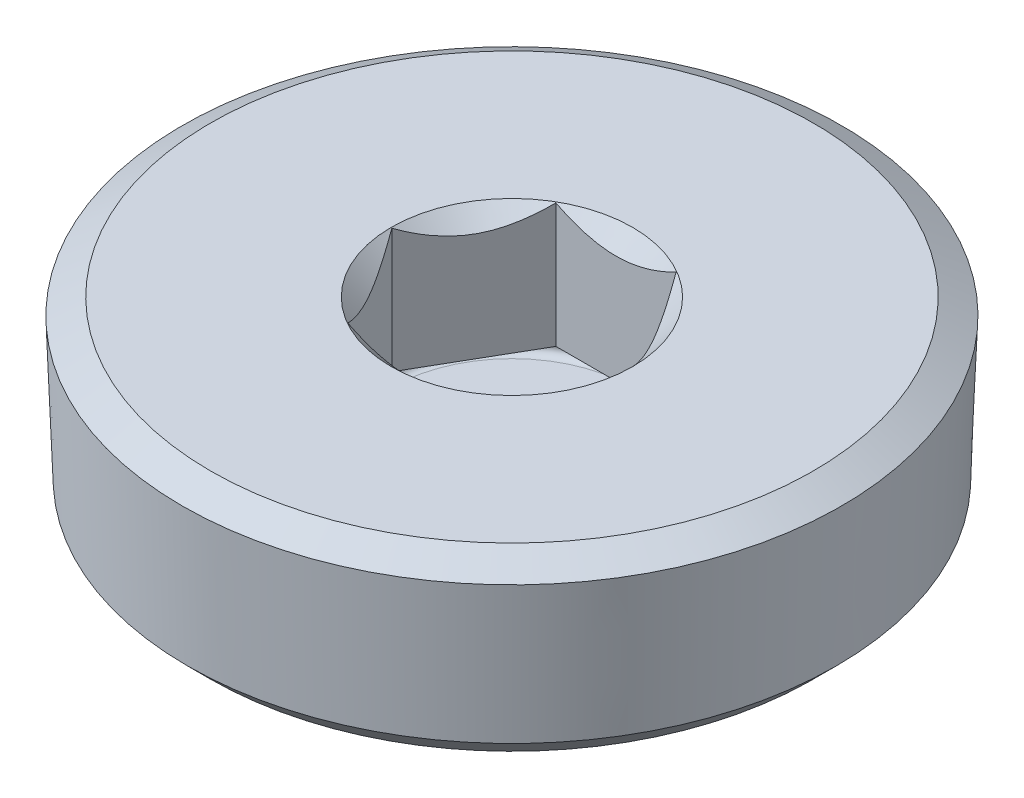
ISO-10303-21;
HEADER;
FILE_DESCRIPTION(('STEP AP214'),'2;1');
FILE_NAME('part.step','',(''),(''),'','','');
FILE_SCHEMA(('AUTOMOTIVE_DESIGN { 1 0 10303 214 1 1 1 1 }'));
ENDSEC;
DATA;
#1=APPLICATION_CONTEXT('core data for automotive mechanical design processes');
#2=APPLICATION_PROTOCOL_DEFINITION('international standard','automotive_design',2000,#1);
#3=PRODUCT_CONTEXT('',#1,'mechanical');
#4=PRODUCT('Part','Part','',(#3));
#5=PRODUCT_RELATED_PRODUCT_CATEGORY('part','',(#4));
#6=PRODUCT_DEFINITION_FORMATION('','',#4);
#7=PRODUCT_DEFINITION_CONTEXT('part definition',#1,'design');
#8=PRODUCT_DEFINITION('design','',#6,#7);
#9=PRODUCT_DEFINITION_SHAPE('','',#8);
#10=(LENGTH_UNIT() NAMED_UNIT(*) SI_UNIT(.MILLI.,.METRE.));
#11=(NAMED_UNIT(*) PLANE_ANGLE_UNIT() SI_UNIT($,.RADIAN.));
#12=(NAMED_UNIT(*) SI_UNIT($,.STERADIAN.) SOLID_ANGLE_UNIT());
#13=UNCERTAINTY_MEASURE_WITH_UNIT(LENGTH_MEASURE(1.E-05),#10,'distance_accuracy_value','');
#14=(GEOMETRIC_REPRESENTATION_CONTEXT(3) GLOBAL_UNCERTAINTY_ASSIGNED_CONTEXT((#13)) GLOBAL_UNIT_ASSIGNED_CONTEXT((#10,
#11,#12)) REPRESENTATION_CONTEXT('',''));
#15=CARTESIAN_POINT('',(0.,0.,0.));
#16=DIRECTION('',(0.,0.,1.));
#17=DIRECTION('',(1.,0.,0.));
#18=AXIS2_PLACEMENT_3D('',#15,#16,#17);
#19=CARTESIAN_POINT('',(0.,0.,0.));
#20=DIRECTION('',(0.,1.,0.));
#21=DIRECTION('',(0.,0.,1.));
#22=AXIS2_PLACEMENT_3D('',#19,#20,#21);
#23=PLANE('',#22);
#24=CARTESIAN_POINT('',(0.,0.,0.));
#25=DIRECTION('',(0.,1.,0.));
#26=DIRECTION('',(0.,0.,1.));
#27=AXIS2_PLACEMENT_3D('',#24,#25,#26);
#28=CIRCLE('',#27,11.049);
#29=CARTESIAN_POINT('',(0.,0.,11.049));
#30=VERTEX_POINT('',#29);
#31=EDGE_CURVE('E203',#30,#30,#28,.T.);
#32=ORIENTED_EDGE('',*,*,#31,.F.);
#33=EDGE_LOOP('',(#32));
#34=FACE_BOUND('',#33,.T.);
#35=CARTESIAN_POINT('',(0.,0.,0.));
#36=DIRECTION('',(0.,1.,0.));
#37=DIRECTION('',(0.,0.,1.));
#38=AXIS2_PLACEMENT_3D('',#35,#36,#37);
#39=CIRCLE('',#38,27.5920682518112);
#40=CARTESIAN_POINT('',(0.,0.,27.5920682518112));
#41=VERTEX_POINT('',#40);
#42=EDGE_CURVE('E95',#41,#41,#39,.T.);
#43=ORIENTED_EDGE('',*,*,#42,.T.);
#44=EDGE_LOOP('',(#43));
#45=FACE_BOUND('',#44,.T.);
#46=ADVANCED_FACE('F33',(#34,#45),#23,.T.);
#47=CARTESIAN_POINT('',(0.,0.,0.));
#48=DIRECTION('',(0.,-1.,0.));
#49=DIRECTION('',(0.,0.,-1.));
#50=AXIS2_PLACEMENT_3D('',#47,#48,#49);
#51=CONICAL_SURFACE('',#50,27.5920682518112,1.0471975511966);
#52=CARTESIAN_POINT('',(0.,-1.48935126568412,0.));
#53=DIRECTION('',(0.,1.,0.));
#54=DIRECTION('',(0.,0.,1.));
#55=AXIS2_PLACEMENT_3D('',#52,#53,#54);
#56=CIRCLE('',#55,30.1717003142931);
#57=CARTESIAN_POINT('',(0.,-1.48935126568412,30.1717003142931));
#58=VERTEX_POINT('',#57);
#59=EDGE_CURVE('E207',#58,#58,#56,.T.);
#60=ORIENTED_EDGE('',*,*,#59,.T.);
#61=EDGE_LOOP('',(#60));
#62=FACE_BOUND('',#61,.T.);
#63=ORIENTED_EDGE('',*,*,#42,.F.);
#64=EDGE_LOOP('',(#63));
#65=FACE_BOUND('',#64,.T.);
#66=ADVANCED_FACE('F193',(#62,#65),#51,.T.);
#67=CARTESIAN_POINT('',(0.,-1.48935126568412,0.));
#68=DIRECTION('',(0.,1.,0.));
#69=DIRECTION('',(0.,0.,1.));
#70=AXIS2_PLACEMENT_3D('',#67,#68,#69);
#71=CONICAL_SURFACE('',#70,30.1717003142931,0.0364424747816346);
#72=CARTESIAN_POINT('',(0.,-14.4011128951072,0.));
#73=DIRECTION('',(0.,1.,0.));
#74=DIRECTION('',(0.,0.,1.));
#75=AXIS2_PLACEMENT_3D('',#72,#73,#74);
#76=CIRCLE('',#75,29.7009553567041);
#77=CARTESIAN_POINT('',(0.,-14.4011128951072,29.7009553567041));
#78=VERTEX_POINT('',#77);
#79=EDGE_CURVE('E210',#78,#78,#76,.T.);
#80=ORIENTED_EDGE('',*,*,#79,.T.);
#81=EDGE_LOOP('',(#80));
#82=FACE_BOUND('',#81,.T.);
#83=ORIENTED_EDGE('',*,*,#59,.F.);
#84=EDGE_LOOP('',(#83));
#85=FACE_BOUND('',#84,.T.);
#86=ADVANCED_FACE('F198',(#82,#85),#71,.T.);
#87=CARTESIAN_POINT('',(0.,-14.4011128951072,0.));
#88=DIRECTION('',(0.,1.,0.));
#89=DIRECTION('',(0.,0.,1.));
#90=AXIS2_PLACEMENT_3D('',#87,#88,#89);
#91=CONICAL_SURFACE('',#90,29.7009553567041,0.785398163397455);
#92=CARTESIAN_POINT('',(0.,-16.51,0.));
#93=DIRECTION('',(0.,1.,0.));
#94=DIRECTION('',(0.,0.,1.));
#95=AXIS2_PLACEMENT_3D('',#92,#93,#94);
#96=CIRCLE('',#95,27.5920682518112);
#97=CARTESIAN_POINT('',(0.,-16.51,27.5920682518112));
#98=VERTEX_POINT('',#97);
#99=EDGE_CURVE('E215',#98,#98,#96,.T.);
#100=ORIENTED_EDGE('',*,*,#99,.T.);
#101=EDGE_LOOP('',(#100));
#102=FACE_BOUND('',#101,.T.);
#103=ORIENTED_EDGE('',*,*,#79,.F.);
#104=EDGE_LOOP('',(#103));
#105=FACE_BOUND('',#104,.T.);
#106=ADVANCED_FACE('F298',(#102,#105),#91,.T.);
#107=CARTESIAN_POINT('',(-27.5920682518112,-16.51,0.));
#108=DIRECTION('',(0.,-1.,0.));
#109=DIRECTION('',(0.,0.,-1.));
#110=AXIS2_PLACEMENT_3D('',#107,#108,#109);
#111=PLANE('',#110);
#112=ORIENTED_EDGE('',*,*,#99,.F.);
#113=EDGE_LOOP('',(#112));
#114=FACE_BOUND('',#113,.T.);
#115=ADVANCED_FACE('F146',(#114),#111,.T.);
#116=CARTESIAN_POINT('',(0.,0.,0.));
#117=DIRECTION('',(0.,1.,0.));
#118=DIRECTION('',(0.,0.,1.));
#119=AXIS2_PLACEMENT_3D('',#116,#117,#118);
#120=CONICAL_SURFACE('',#119,11.049,0.785398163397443);
#121=CARTESIAN_POINT('',(-11.49689211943,3.88097499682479,9.525));
#122=CARTESIAN_POINT('',(-11.2192109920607,3.66719342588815,9.525));
#123=CARTESIAN_POINT('',(-10.9400359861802,3.45532180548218,9.525));
#124=CARTESIAN_POINT('',(-10.3780867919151,3.03627173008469,9.525));
#125=CARTESIAN_POINT('',(-10.0953117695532,2.82909439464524,9.525));
#126=CARTESIAN_POINT('',(-9.5234849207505,2.41883185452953,9.525));
#127=CARTESIAN_POINT('',(-9.23440150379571,2.21579053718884,9.525));
#128=CARTESIAN_POINT('',(-8.65142747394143,1.81675439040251,9.525));
#129=CARTESIAN_POINT('',(-8.35753719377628,1.620759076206,9.525));
#130=CARTESIAN_POINT('',(-7.74525046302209,1.22521931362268,9.525));
#131=CARTESIAN_POINT('',(-7.42648498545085,1.02624324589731,9.525));
#132=CARTESIAN_POINT('',(-6.78146699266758,0.640613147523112,9.525));
#133=CARTESIAN_POINT('',(-6.45521322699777,0.453961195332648,9.525));
#134=CARTESIAN_POINT('',(-5.79512470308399,0.096952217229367,9.525));
#135=CARTESIAN_POINT('',(-5.46131601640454,-0.0734526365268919,9.525));
#136=CARTESIAN_POINT('',(-4.78424953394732,-0.394149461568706,9.525));
#137=CARTESIAN_POINT('',(-4.44099629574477,-0.544450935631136,9.525));
#138=CARTESIAN_POINT('',(-3.77889720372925,-0.805823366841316,9.525));
#139=CARTESIAN_POINT('',(-3.46101405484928,-0.91930823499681,9.525));
#140=CARTESIAN_POINT('',(-2.81713163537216,-1.12083511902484,9.525));
#141=CARTESIAN_POINT('',(-2.49113185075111,-1.20887551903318,9.525));
#142=CARTESIAN_POINT('',(-1.83865140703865,-1.35327332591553,9.525));
#143=CARTESIAN_POINT('',(-1.51230057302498,-1.41020749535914,9.525));
#144=CARTESIAN_POINT('',(-0.855522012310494,-1.49120208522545,9.525));
#145=CARTESIAN_POINT('',(-0.525095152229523,-1.51526937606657,9.525));
#146=CARTESIAN_POINT('',(0.121903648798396,-1.52846981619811,9.525));
#147=CARTESIAN_POINT('',(0.438445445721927,-1.51909358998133,9.525));
#148=CARTESIAN_POINT('',(1.06906801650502,-1.46935129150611,9.525));
#149=CARTESIAN_POINT('',(1.3831485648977,-1.42898241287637,9.525));
#150=CARTESIAN_POINT('',(2.01189915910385,-1.31885442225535,9.525));
#151=CARTESIAN_POINT('',(2.3264766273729,-1.24857566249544,9.525));
#152=CARTESIAN_POINT('',(2.94870072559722,-1.08253292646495,9.525));
#153=CARTESIAN_POINT('',(3.25634774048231,-0.986770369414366,9.525));
#154=CARTESIAN_POINT('',(3.88126120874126,-0.767982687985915,9.525));
#155=CARTESIAN_POINT('',(4.19809084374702,-0.643724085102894,9.525));
#156=CARTESIAN_POINT('',(4.82360317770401,-0.376005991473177,9.525));
#157=CARTESIAN_POINT('',(5.13228213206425,-0.232537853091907,9.525));
#158=CARTESIAN_POINT('',(5.74294917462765,0.0701972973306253,9.525));
#159=CARTESIAN_POINT('',(6.04491295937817,0.229512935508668,9.525));
#160=CARTESIAN_POINT('',(6.64192212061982,0.560437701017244,9.525));
#161=CARTESIAN_POINT('',(6.93696855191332,0.732044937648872,9.525));
#162=CARTESIAN_POINT('',(7.50662944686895,1.07643721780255,9.525));
#163=CARTESIAN_POINT('',(7.78153348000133,1.2487458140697,9.525));
#164=CARTESIAN_POINT('',(8.32661839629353,1.60070008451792,9.525));
#165=CARTESIAN_POINT('',(8.59679892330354,1.78034630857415,9.525));
#166=CARTESIAN_POINT('',(9.13088323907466,2.14420570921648,9.525));
#167=CARTESIAN_POINT('',(9.3948200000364,2.32837066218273,9.525));
#168=CARTESIAN_POINT('',(9.91907224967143,2.70163946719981,9.525));
#169=CARTESIAN_POINT('',(10.1793887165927,2.89074194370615,9.525));
#170=CARTESIAN_POINT('',(10.4381864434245,3.08186555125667,9.525));
#171=B_SPLINE_CURVE_WITH_KNOTS('',3,(#121,#122,#123,#124,#125,#126,#127,#128,#129,#130,#131,
#132,#133,#134,#135,#136,#137,#138,#139,#140,#141,#142,#143,#144,#145,#146,#147,#148,#149,#150,
#151,#152,#153,#154,#155,#156,#157,#158,#159,#160,#161,#162,#163,#164,#165,#166,#167,#168,#169,
#170),.UNSPECIFIED.,.F.,.F.,(4,2,2,2,2,2,2,2,2,2,2,2,2,2,2,2,2,2,2,2,2,2,2,2,4),(0.,
1.05134425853,2.10293667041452,3.16263996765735,4.22227021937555,5.34935795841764,
6.47663529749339,7.60048450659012,8.72380058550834,9.73552741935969,10.7473184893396,
11.7396508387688,12.7317757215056,13.6802435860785,14.6287973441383,15.5945508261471,
16.5602505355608,17.5804442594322,18.6010988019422,19.6249878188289,20.6487196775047,
21.6219085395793,22.5951704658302,23.5606213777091,24.5258061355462),.UNSPECIFIED.);
#172=CARTESIAN_POINT('',(5.49926131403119,-0.0504773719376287,9.525));
#173=VERTEX_POINT('',#172);
#174=CARTESIAN_POINT('',(-5.49926131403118,-0.0504773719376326,9.525));
#175=VERTEX_POINT('',#174);
#176=EDGE_CURVE('E47',#173,#175,#171,.F.);
#177=ORIENTED_EDGE('',*,*,#176,.T.);
#178=CARTESIAN_POINT('',(-5.49914584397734,-0.0503619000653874,9.5252));
#179=CARTESIAN_POINT('',(-5.59369092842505,-0.144893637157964,9.36144311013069));
#180=CARTESIAN_POINT('',(-5.6889764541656,-0.236540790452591,9.19640373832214));
#181=CARTESIAN_POINT('',(-5.88114364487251,-0.413149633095,8.86356040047));
#182=CARTESIAN_POINT('',(-5.97802614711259,-0.498107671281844,8.69575498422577));
#183=CARTESIAN_POINT('',(-6.17395951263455,-0.66078179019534,8.35638844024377));
#184=CARTESIAN_POINT('',(-6.27301961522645,-0.738453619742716,8.18481130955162));
#185=CARTESIAN_POINT('',(-6.47276685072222,-0.88486835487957,7.83883894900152));
#186=CARTESIAN_POINT('',(-6.57345373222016,-0.953612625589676,7.66444415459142));
#187=CARTESIAN_POINT('',(-6.77483563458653,-1.07999715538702,7.31564046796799));
#188=CARTESIAN_POINT('',(-6.87550590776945,-1.13779424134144,7.14127444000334));
#189=CARTESIAN_POINT('',(-7.07825767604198,-1.24243057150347,6.79009807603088));
#190=CARTESIAN_POINT('',(-7.18033901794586,-1.28927099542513,6.61328800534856));
#191=CARTESIAN_POINT('',(-7.38547629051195,-1.37081474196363,6.25797982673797));
#192=CARTESIAN_POINT('',(-7.48852948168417,-1.40554538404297,6.07948646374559));
#193=CARTESIAN_POINT('',(-7.69550102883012,-1.46210640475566,5.72100122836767));
#194=CARTESIAN_POINT('',(-7.79941925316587,-1.48393871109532,5.5410095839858));
#195=CARTESIAN_POINT('',(-8.05265883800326,-1.5205452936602,5.1023857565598));
#196=CARTESIAN_POINT('',(-8.20225391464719,-1.52822719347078,4.84327948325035));
#197=CARTESIAN_POINT('',(-8.50117351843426,-1.51533350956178,4.32553554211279));
#198=CARTESIAN_POINT('',(-8.65049793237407,-1.49474802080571,4.06689807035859));
#199=CARTESIAN_POINT('',(-8.94773915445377,-1.42653463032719,3.55206117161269));
#200=CARTESIAN_POINT('',(-9.09565420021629,-1.37887648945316,3.29586479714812));
#201=CARTESIAN_POINT('',(-9.38894191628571,-1.25910833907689,2.78787557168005));
#202=CARTESIAN_POINT('',(-9.53431478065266,-1.18700020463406,2.53608238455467));
#203=CARTESIAN_POINT('',(-9.79237138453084,-1.03865549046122,2.08911523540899));
#204=CARTESIAN_POINT('',(-9.9056266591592,-0.966321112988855,1.89295134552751));
#205=CARTESIAN_POINT('',(-10.1301042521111,-0.809996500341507,1.504144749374));
#206=CARTESIAN_POINT('',(-10.2413265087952,-0.726005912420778,1.31150214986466));
#207=CARTESIAN_POINT('',(-10.4613877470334,-0.548251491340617,0.930344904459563));
#208=CARTESIAN_POINT('',(-10.5702329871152,-0.454518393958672,0.74181941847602));
#209=CARTESIAN_POINT('',(-10.7859080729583,-0.258509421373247,0.368259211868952));
#210=CARTESIAN_POINT('',(-10.8927391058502,-0.156238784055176,0.183222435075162));
#211=CARTESIAN_POINT('',(-10.9986380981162,-0.0503619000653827,-0.000199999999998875));
#212=B_SPLINE_CURVE_WITH_KNOTS('',3,(#178,#179,#180,#181,#182,#183,#184,#185,#186,#187,#188,
#189,#190,#191,#192,#193,#194,#195,#196,#197,#198,#199,#200,#201,#202,#203,#204,#205,#206,#207,
#208,#209,#210,#211),.UNSPECIFIED.,.F.,.F.,(4,2,2,2,2,2,2,2,2,2,2,2,2,2,2,2,4),(0.,
0.634236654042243,1.26881713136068,1.9070310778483,2.54514731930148,3.17328515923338,
3.80135533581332,4.42799928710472,5.0545495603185,5.95101645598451,6.84779755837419,
7.74558230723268,8.64329822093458,9.35630333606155,10.0693300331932,10.7801718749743,
11.4905807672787),.UNSPECIFIED.);
#213=CARTESIAN_POINT('',(-10.9985226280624,-0.0504773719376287,0.));
#214=VERTEX_POINT('',#213);
#215=EDGE_CURVE('E101',#175,#214,#212,.T.);
#216=ORIENTED_EDGE('',*,*,#215,.T.);
#217=CARTESIAN_POINT('',(-10.9986380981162,-0.0503619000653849,0.000200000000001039));
#218=CARTESIAN_POINT('',(-10.9040930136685,-0.144893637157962,-0.16355688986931));
#219=CARTESIAN_POINT('',(-10.808807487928,-0.236540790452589,-0.328596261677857));
#220=CARTESIAN_POINT('',(-10.616640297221,-0.413149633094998,-0.661439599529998));
#221=CARTESIAN_POINT('',(-10.519757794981,-0.498107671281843,-0.829245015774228));
#222=CARTESIAN_POINT('',(-10.323824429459,-0.660781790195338,-1.16861155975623));
#223=CARTESIAN_POINT('',(-10.2247643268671,-0.738453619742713,-1.34018869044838));
#224=CARTESIAN_POINT('',(-10.0250170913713,-0.884868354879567,-1.68616105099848));
#225=CARTESIAN_POINT('',(-9.92433020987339,-0.953612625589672,-1.86055584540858));
#226=CARTESIAN_POINT('',(-9.72294830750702,-1.07999715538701,-2.20935953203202));
#227=CARTESIAN_POINT('',(-9.62227803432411,-1.13779424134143,-2.38372555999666));
#228=CARTESIAN_POINT('',(-9.41952626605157,-1.24243057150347,-2.73490192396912));
#229=CARTESIAN_POINT('',(-9.3174449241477,-1.28927099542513,-2.91171199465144));
#230=CARTESIAN_POINT('',(-9.1123076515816,-1.37081474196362,-3.26702017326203));
#231=CARTESIAN_POINT('',(-9.00925446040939,-1.40554538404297,-3.44551353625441));
#232=CARTESIAN_POINT('',(-8.80228291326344,-1.46210640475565,-3.80399877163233));
#233=CARTESIAN_POINT('',(-8.69836468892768,-1.48393871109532,-3.98399041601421));
#234=CARTESIAN_POINT('',(-8.4451251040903,-1.52054529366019,-4.42261424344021));
#235=CARTESIAN_POINT('',(-8.29553002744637,-1.52822719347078,-4.68172051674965));
#236=CARTESIAN_POINT('',(-7.9966104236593,-1.51533350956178,-5.19946445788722));
#237=CARTESIAN_POINT('',(-7.84728600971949,-1.4947480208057,-5.45810192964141));
#238=CARTESIAN_POINT('',(-7.55004478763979,-1.42653463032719,-5.97293882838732));
#239=CARTESIAN_POINT('',(-7.40212974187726,-1.37887648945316,-6.22913520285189));
#240=CARTESIAN_POINT('',(-7.10884202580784,-1.25910833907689,-6.73712442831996));
#241=CARTESIAN_POINT('',(-6.96346916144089,-1.18700020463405,-6.98891761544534));
#242=CARTESIAN_POINT('',(-6.70541255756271,-1.03865549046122,-7.43588476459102));
#243=CARTESIAN_POINT('',(-6.59215728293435,-0.966321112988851,-7.6320486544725));
#244=CARTESIAN_POINT('',(-6.36767968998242,-0.809996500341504,-8.02085525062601));
#245=CARTESIAN_POINT('',(-6.25645743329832,-0.726005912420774,-8.21349785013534));
#246=CARTESIAN_POINT('',(-6.03639619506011,-0.548251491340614,-8.59465509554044));
#247=CARTESIAN_POINT('',(-5.92755095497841,-0.454518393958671,-8.78318058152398));
#248=CARTESIAN_POINT('',(-5.71187586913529,-0.258509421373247,-9.15674078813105));
#249=CARTESIAN_POINT('',(-5.60504483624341,-0.156238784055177,-9.34177756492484));
#250=CARTESIAN_POINT('',(-5.49914584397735,-0.0503619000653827,-9.5252));
#251=B_SPLINE_CURVE_WITH_KNOTS('',3,(#217,#218,#219,#220,#221,#222,#223,#224,#225,#226,#227,
#228,#229,#230,#231,#232,#233,#234,#235,#236,#237,#238,#239,#240,#241,#242,#243,#244,#245,#246,
#247,#248,#249,#250),.UNSPECIFIED.,.F.,.F.,(4,2,2,2,2,2,2,2,2,2,2,2,2,2,2,2,4),(0.,
0.634236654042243,1.26881713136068,1.9070310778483,2.54514731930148,3.17328515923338,
3.80135533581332,4.42799928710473,5.0545495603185,5.95101645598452,6.84779755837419,
7.74558230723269,8.64329822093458,9.35630333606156,10.0693300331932,10.7801718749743,
11.4905807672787),.UNSPECIFIED.);
#252=CARTESIAN_POINT('',(-5.49926131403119,-0.0504773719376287,-9.525));
#253=VERTEX_POINT('',#252);
#254=EDGE_CURVE('E167',#214,#253,#251,.T.);
#255=ORIENTED_EDGE('',*,*,#254,.T.);
#256=CARTESIAN_POINT('',(-11.49689211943,3.8809749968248,-9.525));
#257=CARTESIAN_POINT('',(-11.2192109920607,3.66719342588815,-9.525));
#258=CARTESIAN_POINT('',(-10.9400359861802,3.45532180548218,-9.525));
#259=CARTESIAN_POINT('',(-10.3780867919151,3.03627173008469,-9.525));
#260=CARTESIAN_POINT('',(-10.0953117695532,2.82909439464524,-9.525));
#261=CARTESIAN_POINT('',(-9.5234849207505,2.41883185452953,-9.525));
#262=CARTESIAN_POINT('',(-9.23440150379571,2.21579053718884,-9.525));
#263=CARTESIAN_POINT('',(-8.65142747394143,1.81675439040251,-9.525));
#264=CARTESIAN_POINT('',(-8.35753719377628,1.620759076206,-9.525));
#265=CARTESIAN_POINT('',(-7.74525046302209,1.22521931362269,-9.525));
#266=CARTESIAN_POINT('',(-7.42648498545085,1.02624324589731,-9.525));
#267=CARTESIAN_POINT('',(-6.78146699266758,0.640613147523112,-9.525));
#268=CARTESIAN_POINT('',(-6.45521322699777,0.453961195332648,-9.525));
#269=CARTESIAN_POINT('',(-5.79512470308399,0.0969522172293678,-9.525));
#270=CARTESIAN_POINT('',(-5.46131601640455,-0.0734526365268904,-9.525));
#271=CARTESIAN_POINT('',(-4.78424953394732,-0.394149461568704,-9.525));
#272=CARTESIAN_POINT('',(-4.44099629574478,-0.544450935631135,-9.525));
#273=CARTESIAN_POINT('',(-3.77889720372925,-0.805823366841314,-9.525));
#274=CARTESIAN_POINT('',(-3.46101405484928,-0.919308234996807,-9.525));
#275=CARTESIAN_POINT('',(-2.81713163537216,-1.12083511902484,-9.525));
#276=CARTESIAN_POINT('',(-2.49113185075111,-1.20887551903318,-9.525));
#277=CARTESIAN_POINT('',(-1.83865140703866,-1.35327332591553,-9.525));
#278=CARTESIAN_POINT('',(-1.51230057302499,-1.41020749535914,-9.525));
#279=CARTESIAN_POINT('',(-0.855522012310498,-1.49120208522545,-9.525));
#280=CARTESIAN_POINT('',(-0.525095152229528,-1.51526937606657,-9.525));
#281=CARTESIAN_POINT('',(0.121903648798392,-1.52846981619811,-9.525));
#282=CARTESIAN_POINT('',(0.438445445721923,-1.51909358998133,-9.525));
#283=CARTESIAN_POINT('',(1.06906801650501,-1.46935129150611,-9.525));
#284=CARTESIAN_POINT('',(1.3831485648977,-1.42898241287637,-9.525));
#285=CARTESIAN_POINT('',(2.01189915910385,-1.31885442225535,-9.525));
#286=CARTESIAN_POINT('',(2.32647662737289,-1.24857566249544,-9.525));
#287=CARTESIAN_POINT('',(2.94870072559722,-1.08253292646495,-9.525));
#288=CARTESIAN_POINT('',(3.25634774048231,-0.986770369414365,-9.525));
#289=CARTESIAN_POINT('',(3.88126120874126,-0.767982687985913,-9.525));
#290=CARTESIAN_POINT('',(4.19809084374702,-0.643724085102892,-9.525));
#291=CARTESIAN_POINT('',(4.823603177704,-0.376005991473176,-9.525));
#292=CARTESIAN_POINT('',(5.13228213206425,-0.232537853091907,-9.525));
#293=CARTESIAN_POINT('',(5.74294917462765,0.070197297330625,-9.525));
#294=CARTESIAN_POINT('',(6.04491295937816,0.229512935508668,-9.525));
#295=CARTESIAN_POINT('',(6.64192212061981,0.560437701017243,-9.525));
#296=CARTESIAN_POINT('',(6.93696855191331,0.732044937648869,-9.525));
#297=CARTESIAN_POINT('',(7.50662944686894,1.07643721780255,-9.525));
#298=CARTESIAN_POINT('',(7.78153348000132,1.24874581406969,-9.525));
#299=CARTESIAN_POINT('',(8.32661839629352,1.60070008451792,-9.525));
#300=CARTESIAN_POINT('',(8.59679892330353,1.78034630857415,-9.525));
#301=CARTESIAN_POINT('',(9.13088323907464,2.14420570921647,-9.525));
#302=CARTESIAN_POINT('',(9.39482000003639,2.32837066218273,-9.525));
#303=CARTESIAN_POINT('',(9.91907224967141,2.7016394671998,-9.525));
#304=CARTESIAN_POINT('',(10.1793887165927,2.89074194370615,-9.525));
#305=CARTESIAN_POINT('',(10.4381864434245,3.08186555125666,-9.525));
#306=B_SPLINE_CURVE_WITH_KNOTS('',3,(#256,#257,#258,#259,#260,#261,#262,#263,#264,#265,#266,
#267,#268,#269,#270,#271,#272,#273,#274,#275,#276,#277,#278,#279,#280,#281,#282,#283,#284,#285,
#286,#287,#288,#289,#290,#291,#292,#293,#294,#295,#296,#297,#298,#299,#300,#301,#302,#303,#304,
#305),.UNSPECIFIED.,.F.,.F.,(4,2,2,2,2,2,2,2,2,2,2,2,2,2,2,2,2,2,2,2,2,2,2,2,4),(0.,
1.05134425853,2.10293667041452,3.16263996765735,4.22227021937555,5.34935795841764,
6.47663529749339,7.60048450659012,8.72380058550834,9.73552741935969,10.7473184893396,
11.7396508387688,12.7317757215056,13.6802435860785,14.6287973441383,15.5945508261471,
16.5602505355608,17.5804442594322,18.6010988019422,19.6249878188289,20.6487196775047,
21.6219085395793,22.5951704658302,23.5606213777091,24.5258061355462),.UNSPECIFIED.);
#307=CARTESIAN_POINT('',(5.49926131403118,-0.0504773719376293,-9.525));
#308=VERTEX_POINT('',#307);
#309=EDGE_CURVE('E161',#253,#308,#306,.T.);
#310=ORIENTED_EDGE('',*,*,#309,.T.);
#311=CARTESIAN_POINT('',(5.49914584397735,-0.0503619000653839,-9.5252));
#312=CARTESIAN_POINT('',(5.59369092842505,-0.144893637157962,-9.36144311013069));
#313=CARTESIAN_POINT('',(5.6889764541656,-0.236540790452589,-9.19640373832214));
#314=CARTESIAN_POINT('',(5.88114364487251,-0.413149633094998,-8.86356040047));
#315=CARTESIAN_POINT('',(5.97802614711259,-0.498107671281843,-8.69575498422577));
#316=CARTESIAN_POINT('',(6.17395951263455,-0.660781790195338,-8.35638844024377));
#317=CARTESIAN_POINT('',(6.27301961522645,-0.738453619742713,-8.18481130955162));
#318=CARTESIAN_POINT('',(6.47276685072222,-0.884868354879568,-7.83883894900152));
#319=CARTESIAN_POINT('',(6.57345373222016,-0.953612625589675,-7.66444415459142));
#320=CARTESIAN_POINT('',(6.77483563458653,-1.07999715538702,-7.31564046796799));
#321=CARTESIAN_POINT('',(6.87550590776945,-1.13779424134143,-7.14127444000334));
#322=CARTESIAN_POINT('',(7.07825767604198,-1.24243057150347,-6.79009807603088));
#323=CARTESIAN_POINT('',(7.18033901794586,-1.28927099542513,-6.61328800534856));
#324=CARTESIAN_POINT('',(7.38547629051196,-1.37081474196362,-6.25797982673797));
#325=CARTESIAN_POINT('',(7.48852948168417,-1.40554538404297,-6.07948646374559));
#326=CARTESIAN_POINT('',(7.69550102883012,-1.46210640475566,-5.72100122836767));
#327=CARTESIAN_POINT('',(7.79941925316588,-1.48393871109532,-5.5410095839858));
#328=CARTESIAN_POINT('',(8.05265883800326,-1.52054529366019,-5.1023857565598));
#329=CARTESIAN_POINT('',(8.20225391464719,-1.52822719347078,-4.84327948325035));
#330=CARTESIAN_POINT('',(8.50117351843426,-1.51533350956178,-4.32553554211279));
#331=CARTESIAN_POINT('',(8.65049793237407,-1.4947480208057,-4.06689807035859));
#332=CARTESIAN_POINT('',(8.94773915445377,-1.42653463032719,-3.55206117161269));
#333=CARTESIAN_POINT('',(9.09565420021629,-1.37887648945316,-3.29586479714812));
#334=CARTESIAN_POINT('',(9.38894191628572,-1.25910833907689,-2.78787557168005));
#335=CARTESIAN_POINT('',(9.53431478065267,-1.18700020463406,-2.53608238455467));
#336=CARTESIAN_POINT('',(9.79237138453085,-1.03865549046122,-2.08911523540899));
#337=CARTESIAN_POINT('',(9.9056266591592,-0.966321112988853,-1.8929513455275));
#338=CARTESIAN_POINT('',(10.1301042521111,-0.809996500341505,-1.50414474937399));
#339=CARTESIAN_POINT('',(10.2413265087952,-0.726005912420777,-1.31150214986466));
#340=CARTESIAN_POINT('',(10.4613877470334,-0.548251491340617,-0.930344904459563));
#341=CARTESIAN_POINT('',(10.5702329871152,-0.454518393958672,-0.741819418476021));
#342=CARTESIAN_POINT('',(10.7859080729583,-0.258509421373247,-0.368259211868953));
#343=CARTESIAN_POINT('',(10.8927391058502,-0.156238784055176,-0.183222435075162));
#344=CARTESIAN_POINT('',(10.9986380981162,-0.0503619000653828,0.00019999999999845));
#345=B_SPLINE_CURVE_WITH_KNOTS('',3,(#311,#312,#313,#314,#315,#316,#317,#318,#319,#320,#321,
#322,#323,#324,#325,#326,#327,#328,#329,#330,#331,#332,#333,#334,#335,#336,#337,#338,#339,#340,
#341,#342,#343,#344),.UNSPECIFIED.,.F.,.F.,(4,2,2,2,2,2,2,2,2,2,2,2,2,2,2,2,4),(0.,
0.634236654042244,1.26881713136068,1.9070310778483,2.54514731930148,3.17328515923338,
3.80135533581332,4.42799928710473,5.0545495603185,5.95101645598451,6.84779755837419,
7.74558230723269,8.64329822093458,9.35630333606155,10.0693300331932,10.7801718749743,
11.4905807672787),.UNSPECIFIED.);
#346=CARTESIAN_POINT('',(10.9985226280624,-0.0504773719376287,0.));
#347=VERTEX_POINT('',#346);
#348=EDGE_CURVE('E155',#308,#347,#345,.T.);
#349=ORIENTED_EDGE('',*,*,#348,.T.);
#350=CARTESIAN_POINT('',(10.9986380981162,-0.0503619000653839,-0.000200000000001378));
#351=CARTESIAN_POINT('',(10.9040930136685,-0.144893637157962,0.163556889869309));
#352=CARTESIAN_POINT('',(10.808807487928,-0.236540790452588,0.328596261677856));
#353=CARTESIAN_POINT('',(10.616640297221,-0.413149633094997,0.661439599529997));
#354=CARTESIAN_POINT('',(10.519757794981,-0.498107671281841,0.829245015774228));
#355=CARTESIAN_POINT('',(10.323824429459,-0.660781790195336,1.16861155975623));
#356=CARTESIAN_POINT('',(10.2247643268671,-0.738453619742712,1.34018869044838));
#357=CARTESIAN_POINT('',(10.0250170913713,-0.884868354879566,1.68616105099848));
#358=CARTESIAN_POINT('',(9.92433020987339,-0.953612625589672,1.86055584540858));
#359=CARTESIAN_POINT('',(9.72294830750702,-1.07999715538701,2.20935953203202));
#360=CARTESIAN_POINT('',(9.62227803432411,-1.13779424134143,2.38372555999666));
#361=CARTESIAN_POINT('',(9.41952626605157,-1.24243057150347,2.73490192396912));
#362=CARTESIAN_POINT('',(9.3174449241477,-1.28927099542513,2.91171199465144));
#363=CARTESIAN_POINT('',(9.1123076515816,-1.37081474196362,3.26702017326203));
#364=CARTESIAN_POINT('',(9.00925446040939,-1.40554538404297,3.44551353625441));
#365=CARTESIAN_POINT('',(8.80228291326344,-1.46210640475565,3.80399877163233));
#366=CARTESIAN_POINT('',(8.69836468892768,-1.48393871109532,3.98399041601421));
#367=CARTESIAN_POINT('',(8.4451251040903,-1.5205452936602,4.42261424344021));
#368=CARTESIAN_POINT('',(8.29553002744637,-1.52822719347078,4.68172051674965));
#369=CARTESIAN_POINT('',(7.9966104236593,-1.51533350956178,5.19946445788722));
#370=CARTESIAN_POINT('',(7.84728600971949,-1.4947480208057,5.45810192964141));
#371=CARTESIAN_POINT('',(7.55004478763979,-1.42653463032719,5.97293882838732));
#372=CARTESIAN_POINT('',(7.40212974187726,-1.37887648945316,6.22913520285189));
#373=CARTESIAN_POINT('',(7.10884202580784,-1.25910833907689,6.73712442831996));
#374=CARTESIAN_POINT('',(6.96346916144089,-1.18700020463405,6.98891761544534));
#375=CARTESIAN_POINT('',(6.70541255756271,-1.03865549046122,7.43588476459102));
#376=CARTESIAN_POINT('',(6.59215728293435,-0.966321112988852,7.6320486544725));
#377=CARTESIAN_POINT('',(6.36767968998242,-0.809996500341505,8.02085525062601));
#378=CARTESIAN_POINT('',(6.25645743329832,-0.726005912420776,8.21349785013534));
#379=CARTESIAN_POINT('',(6.03639619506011,-0.548251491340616,8.59465509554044));
#380=CARTESIAN_POINT('',(5.92755095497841,-0.454518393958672,8.78318058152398));
#381=CARTESIAN_POINT('',(5.71187586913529,-0.258509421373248,9.15674078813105));
#382=CARTESIAN_POINT('',(5.60504483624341,-0.156238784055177,9.34177756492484));
#383=CARTESIAN_POINT('',(5.49914584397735,-0.0503619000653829,9.5252));
#384=B_SPLINE_CURVE_WITH_KNOTS('',3,(#350,#351,#352,#353,#354,#355,#356,#357,#358,#359,#360,
#361,#362,#363,#364,#365,#366,#367,#368,#369,#370,#371,#372,#373,#374,#375,#376,#377,#378,#379,
#380,#381,#382,#383),.UNSPECIFIED.,.F.,.F.,(4,2,2,2,2,2,2,2,2,2,2,2,2,2,2,2,4),(0.,
0.634236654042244,1.26881713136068,1.9070310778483,2.54514731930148,3.17328515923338,
3.80135533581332,4.42799928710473,5.0545495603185,5.95101645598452,6.84779755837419,
7.74558230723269,8.64329822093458,9.35630333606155,10.0693300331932,10.7801718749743,
11.4905807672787),.UNSPECIFIED.);
#385=EDGE_CURVE('E120',#347,#173,#384,.T.);
#386=ORIENTED_EDGE('',*,*,#385,.T.);
#387=EDGE_LOOP('',(#177,#216,#255,#310,#349,#386));
#388=FACE_BOUND('',#387,.T.);
#389=ORIENTED_EDGE('',*,*,#31,.T.);
#390=EDGE_LOOP('',(#389));
#391=FACE_BOUND('',#390,.T.);
#392=ADVANCED_FACE('F141',(#388,#391),#120,.F.);
#393=CARTESIAN_POINT('',(-10.9985226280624,-11.43,0.));
#394=DIRECTION('',(-0.866025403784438,0.,0.5));
#395=DIRECTION('',(0.5,0.,0.866025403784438));
#396=AXIS2_PLACEMENT_3D('',#393,#394,#395);
#397=PLANE('',#396);
#398=DIRECTION('',(0.,1.,0.));
#399=VECTOR('',#398,1.);
#400=CARTESIAN_POINT('',(-5.49926131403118,-11.43,9.525));
#401=LINE('',#400,#399);
#402=CARTESIAN_POINT('',(-5.49926131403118,-11.43,9.525));
#403=VERTEX_POINT('',#402);
#404=EDGE_CURVE('E89',#403,#175,#401,.T.);
#405=ORIENTED_EDGE('',*,*,#404,.F.);
#406=DIRECTION('',(0.5,0.,0.866025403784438));
#407=VECTOR('',#406,1.);
#408=CARTESIAN_POINT('',(-10.6301419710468,-11.43,0.638054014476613));
#409=LINE('',#408,#407);
#410=CARTESIAN_POINT('',(-10.9985226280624,-11.43,0.));
#411=VERTEX_POINT('',#410);
#412=EDGE_CURVE('E94',#411,#403,#409,.T.);
#413=ORIENTED_EDGE('',*,*,#412,.F.);
#414=DIRECTION('',(0.,1.,0.));
#415=VECTOR('',#414,1.);
#416=CARTESIAN_POINT('',(-10.9985226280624,-11.43,0.));
#417=LINE('',#416,#415);
#418=EDGE_CURVE('E133',#411,#214,#417,.T.);
#419=ORIENTED_EDGE('',*,*,#418,.T.);
#420=ORIENTED_EDGE('',*,*,#215,.F.);
#421=EDGE_LOOP('',(#405,#413,#419,#420));
#422=FACE_BOUND('',#421,.T.);
#423=ADVANCED_FACE('F98',(#422),#397,.F.);
#424=CARTESIAN_POINT('',(-5.49926131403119,-11.43,-9.525));
#425=DIRECTION('',(-0.866025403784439,0.,-0.5));
#426=DIRECTION('',(-0.5,0.,0.866025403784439));
#427=AXIS2_PLACEMENT_3D('',#424,#425,#426);
#428=PLANE('',#427);
#429=ORIENTED_EDGE('',*,*,#418,.F.);
#430=DIRECTION('',(-0.5,0.,0.866025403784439));
#431=VECTOR('',#430,1.);
#432=CARTESIAN_POINT('',(-10.6301419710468,-11.43,-0.638054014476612));
#433=LINE('',#432,#431);
#434=CARTESIAN_POINT('',(-5.49926131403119,-11.43,-9.525));
#435=VERTEX_POINT('',#434);
#436=EDGE_CURVE('E106',#435,#411,#433,.T.);
#437=ORIENTED_EDGE('',*,*,#436,.F.);
#438=DIRECTION('',(0.,1.,0.));
#439=VECTOR('',#438,1.);
#440=CARTESIAN_POINT('',(-5.49926131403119,-11.43,-9.525));
#441=LINE('',#440,#439);
#442=EDGE_CURVE('E122',#435,#253,#441,.T.);
#443=ORIENTED_EDGE('',*,*,#442,.T.);
#444=ORIENTED_EDGE('',*,*,#254,.F.);
#445=EDGE_LOOP('',(#429,#437,#443,#444));
#446=FACE_BOUND('',#445,.T.);
#447=ADVANCED_FACE('F176',(#446),#428,.F.);
#448=CARTESIAN_POINT('',(5.49926131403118,-11.43,-9.525));
#449=DIRECTION('',(0.,0.,-1.));
#450=DIRECTION('',(-1.,0.,0.));
#451=AXIS2_PLACEMENT_3D('',#448,#449,#450);
#452=PLANE('',#451);
#453=ORIENTED_EDGE('',*,*,#442,.F.);
#454=DIRECTION('',(-1.,0.,0.));
#455=VECTOR('',#454,1.);
#456=CARTESIAN_POINT('',(-9.525,-11.43,-9.525));
#457=LINE('',#456,#455);
#458=CARTESIAN_POINT('',(5.49926131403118,-11.43,-9.525));
#459=VERTEX_POINT('',#458);
#460=EDGE_CURVE('E12',#459,#435,#457,.T.);
#461=ORIENTED_EDGE('',*,*,#460,.F.);
#462=DIRECTION('',(0.,1.,0.));
#463=VECTOR('',#462,1.);
#464=CARTESIAN_POINT('',(5.49926131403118,-11.43,-9.525));
#465=LINE('',#464,#463);
#466=EDGE_CURVE('E117',#459,#308,#465,.T.);
#467=ORIENTED_EDGE('',*,*,#466,.T.);
#468=ORIENTED_EDGE('',*,*,#309,.F.);
#469=EDGE_LOOP('',(#453,#461,#467,#468));
#470=FACE_BOUND('',#469,.T.);
#471=ADVANCED_FACE('F179',(#470),#452,.F.);
#472=CARTESIAN_POINT('',(10.9985226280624,-11.43,0.));
#473=DIRECTION('',(0.866025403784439,0.,-0.5));
#474=DIRECTION('',(-0.5,0.,-0.866025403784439));
#475=AXIS2_PLACEMENT_3D('',#472,#473,#474);
#476=PLANE('',#475);
#477=ORIENTED_EDGE('',*,*,#466,.F.);
#478=DIRECTION('',(-0.5,0.,-0.866025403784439));
#479=VECTOR('',#478,1.);
#480=CARTESIAN_POINT('',(5.86764197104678,-11.43,-8.88694598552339));
#481=LINE('',#480,#479);
#482=CARTESIAN_POINT('',(10.9985226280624,-11.43,0.));
#483=VERTEX_POINT('',#482);
#484=EDGE_CURVE('E40',#483,#459,#481,.T.);
#485=ORIENTED_EDGE('',*,*,#484,.F.);
#486=DIRECTION('',(0.,1.,0.));
#487=VECTOR('',#486,1.);
#488=CARTESIAN_POINT('',(10.9985226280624,-11.43,0.));
#489=LINE('',#488,#487);
#490=EDGE_CURVE('E115',#483,#347,#489,.T.);
#491=ORIENTED_EDGE('',*,*,#490,.T.);
#492=ORIENTED_EDGE('',*,*,#348,.F.);
#493=EDGE_LOOP('',(#477,#485,#491,#492));
#494=FACE_BOUND('',#493,.T.);
#495=ADVANCED_FACE('F113',(#494),#476,.F.);
#496=CARTESIAN_POINT('',(5.49926131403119,-11.43,9.525));
#497=DIRECTION('',(0.866025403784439,0.,0.5));
#498=DIRECTION('',(0.5,0.,-0.866025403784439));
#499=AXIS2_PLACEMENT_3D('',#496,#497,#498);
#500=PLANE('',#499);
#501=ORIENTED_EDGE('',*,*,#490,.F.);
#502=DIRECTION('',(0.5,0.,-0.866025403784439));
#503=VECTOR('',#502,1.);
#504=CARTESIAN_POINT('',(5.86764197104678,-11.43,8.88694598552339));
#505=LINE('',#504,#503);
#506=CARTESIAN_POINT('',(5.49926131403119,-11.43,9.525));
#507=VERTEX_POINT('',#506);
#508=EDGE_CURVE('E55',#507,#483,#505,.T.);
#509=ORIENTED_EDGE('',*,*,#508,.F.);
#510=DIRECTION('',(0.,1.,0.));
#511=VECTOR('',#510,1.);
#512=CARTESIAN_POINT('',(5.49926131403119,-11.43,9.525));
#513=LINE('',#512,#511);
#514=EDGE_CURVE('E91',#507,#173,#513,.T.);
#515=ORIENTED_EDGE('',*,*,#514,.T.);
#516=ORIENTED_EDGE('',*,*,#385,.F.);
#517=EDGE_LOOP('',(#501,#509,#515,#516));
#518=FACE_BOUND('',#517,.T.);
#519=ADVANCED_FACE('F119',(#518),#500,.F.);
#520=CARTESIAN_POINT('',(-5.49926131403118,-11.43,9.525));
#521=DIRECTION('',(0.,0.,1.));
#522=DIRECTION('',(1.,0.,0.));
#523=AXIS2_PLACEMENT_3D('',#520,#521,#522);
#524=PLANE('',#523);
#525=ORIENTED_EDGE('',*,*,#514,.F.);
#526=DIRECTION('',(1.,0.,0.));
#527=VECTOR('',#526,1.);
#528=CARTESIAN_POINT('',(-9.525,-11.43,9.525));
#529=LINE('',#528,#527);
#530=EDGE_CURVE('E86',#403,#507,#529,.T.);
#531=ORIENTED_EDGE('',*,*,#530,.F.);
#532=ORIENTED_EDGE('',*,*,#404,.T.);
#533=ORIENTED_EDGE('',*,*,#176,.F.);
#534=EDGE_LOOP('',(#525,#531,#532,#533));
#535=FACE_BOUND('',#534,.T.);
#536=ADVANCED_FACE('F88',(#535),#524,.F.);
#537=CARTESIAN_POINT('',(-11.049,-12.7,0.));
#538=DIRECTION('',(0.,-1.,0.));
#539=DIRECTION('',(0.,0.,-1.));
#540=AXIS2_PLACEMENT_3D('',#537,#538,#539);
#541=PLANE('',#540);
#542=CARTESIAN_POINT('',(0.,-12.7,0.));
#543=DIRECTION('',(0.,1.,0.));
#544=DIRECTION('',(0.,0.,1.));
#545=AXIS2_PLACEMENT_3D('',#542,#543,#544);
#546=CIRCLE('',#545,11.049);
#547=CARTESIAN_POINT('',(0.,-12.7,11.049));
#548=VERTEX_POINT('',#547);
#549=EDGE_CURVE('E221',#548,#548,#546,.T.);
#550=ORIENTED_EDGE('',*,*,#549,.T.);
#551=EDGE_LOOP('',(#550));
#552=FACE_BOUND('',#551,.T.);
#553=ADVANCED_FACE('F191',(#552),#541,.F.);
#554=CARTESIAN_POINT('',(0.,-12.065,0.));
#555=DIRECTION('',(0.,1.,0.));
#556=DIRECTION('',(0.,0.,1.));
#557=AXIS2_PLACEMENT_3D('',#554,#555,#556);
#558=TOROIDAL_SURFACE('',#557,11.049,0.634999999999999);
#559=ORIENTED_EDGE('',*,*,#549,.F.);
#560=EDGE_LOOP('',(#559));
#561=FACE_BOUND('',#560,.T.);
#562=CARTESIAN_POINT('',(0.,-11.43,0.));
#563=DIRECTION('',(0.,1.,0.));
#564=DIRECTION('',(0.,0.,1.));
#565=AXIS2_PLACEMENT_3D('',#562,#563,#564);
#566=CIRCLE('',#565,11.049);
#567=CARTESIAN_POINT('',(0.,-11.43,11.049));
#568=VERTEX_POINT('',#567);
#569=EDGE_CURVE('E219',#568,#568,#566,.T.);
#570=ORIENTED_EDGE('',*,*,#569,.T.);
#571=EDGE_LOOP('',(#570));
#572=FACE_BOUND('',#571,.T.);
#573=ADVANCED_FACE('F232',(#561,#572),#558,.F.);
#574=CARTESIAN_POINT('',(-9.525,-11.43,0.));
#575=DIRECTION('',(0.,1.,0.));
#576=DIRECTION('',(0.,0.,1.));
#577=AXIS2_PLACEMENT_3D('',#574,#575,#576);
#578=PLANE('',#577);
#579=ORIENTED_EDGE('',*,*,#569,.F.);
#580=EDGE_LOOP('',(#579));
#581=FACE_BOUND('',#580,.T.);
#582=ORIENTED_EDGE('',*,*,#484,.T.);
#583=ORIENTED_EDGE('',*,*,#460,.T.);
#584=ORIENTED_EDGE('',*,*,#436,.T.);
#585=ORIENTED_EDGE('',*,*,#412,.T.);
#586=ORIENTED_EDGE('',*,*,#530,.T.);
#587=ORIENTED_EDGE('',*,*,#508,.T.);
#588=EDGE_LOOP('',(#582,#583,#584,#585,#586,#587));
#589=FACE_BOUND('',#588,.T.);
#590=ADVANCED_FACE('F105',(#581,#589),#578,.F.);
#591=CLOSED_SHELL('',(#46,#66,#86,#106,#115,#392,#423,#447,#471,#495,#519,#536,#553,#573,#590));
#592=MANIFOLD_SOLID_BREP('B2',#591);
#593=ADVANCED_BREP_SHAPE_REPRESENTATION('',(#18,#592),#14);
#594=SHAPE_DEFINITION_REPRESENTATION(#9,#593);
ENDSEC;
END-ISO-10303-21;
